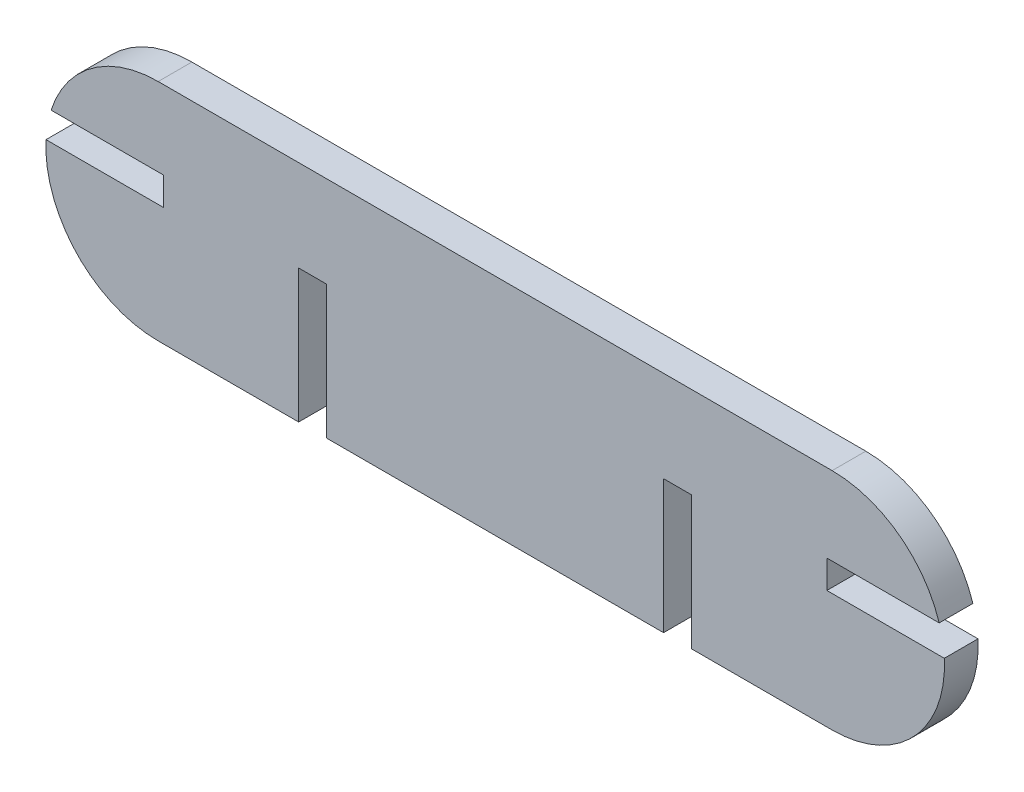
from build123d import *

# Parameters (mm, degrees)
BOSS_EXTRUDE1_DEPTH = 3


with BuildPart() as part:
    # Sketch1 → Boss-Extrude1 (new body)
    with BuildSketch(Plane.XY):
        with BuildLine():
            Line((-30, 8.225), (30, 8.225))
            ThreePointArc((30, 8.225), (35.905505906, 6.295006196), (39.531493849, 1.25))
            Line((39.531493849, 1.25), (29.531493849, 1.25))
            Line((29.531493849, 1.25), (29.531493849, -1.25))
            Line((29.531493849, -1.25), (39.986209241, -1.25))
            ThreePointArc((39.986209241, -1.25), (37.254309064, -8.657949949), (30, -11.775))
            Line((30, -11.775), (17.493642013, -11.775))
            Line((17.493642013, -11.775), (17.493642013, 0.1))
            Line((17.493642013, 0.1), (14.993642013, 0.1))
            Line((14.993642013, 0.1), (14.993642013, -11.775))
            Line((14.993642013, -11.775), (-14.993642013, -11.775))
            Line((-14.993642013, -11.775), (-14.993642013, 0.1))
            Line((-14.993642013, 0.1), (-17.493642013, 0.1))
            Line((-17.493642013, 0.1), (-17.493642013, -11.775))
            Line((-17.493642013, -11.775), (-30, -11.775))
            ThreePointArc((-30, -11.775), (-37.254309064, -8.657949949), (-39.986209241, -1.25))
            Line((-39.986209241, -1.25), (-29.531493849, -1.25))
            Line((-29.531493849, -1.25), (-29.531493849, 1.25))
            Line((-29.531493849, 1.25), (-39.531493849, 1.25))
            ThreePointArc((-39.531493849, 1.25), (-35.905505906, 6.295006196), (-30, 8.225))
        make_face()
    extrude(amount=BOSS_EXTRUDE1_DEPTH)


solid = part.part
